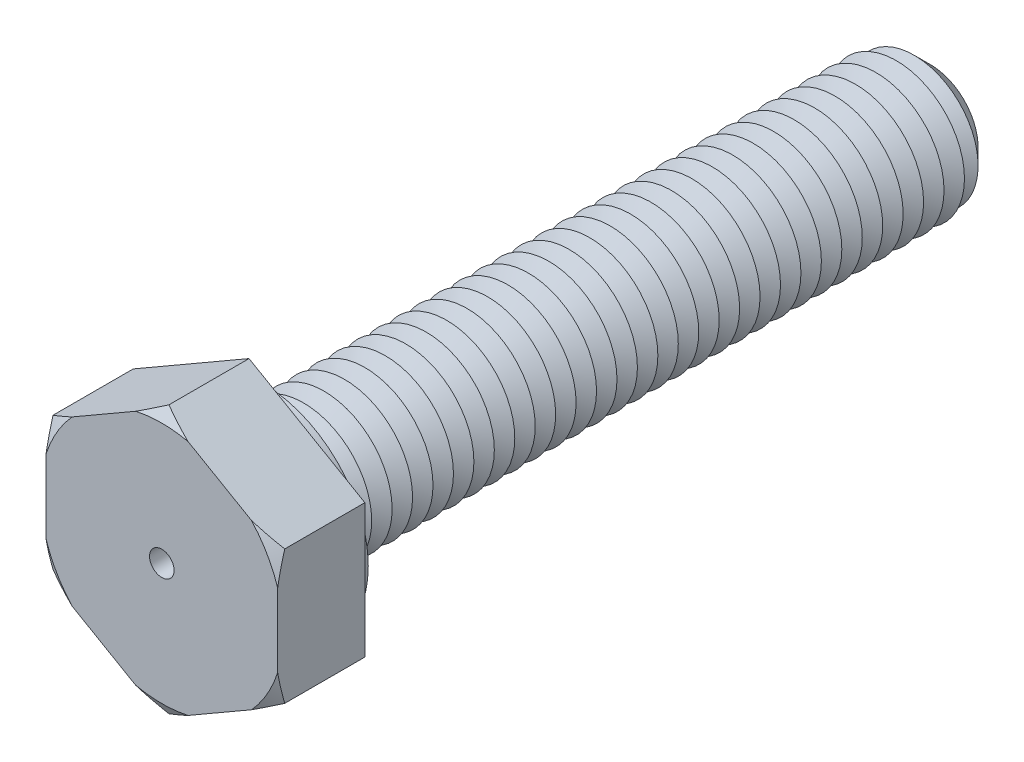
from build123d import *

# Parameters (mm, degrees)
BOSS_EXTRUDE1_DEPTH = 6.4
SKETCH3_R           = 5
BOSS_EXTRUDE2_DEPTH = 50
SKETCH4_R           = 7.75
BOSS_EXTRUDE3_DEPTH = 1
CHAMFER1_SIZE       = 1.5
LPATTERN1_COUNT     = 32
LPATTERN1_PITCH     = 1.5
SKETCH8_R           = 0.9
CUT_EXTRUDE1_DEPTH  = 56.4


with BuildPart() as part:
    # Sketch2 → Boss-Extrude1 (new body)
    with BuildSketch(Plane.XY):
        Polygon((0, 9.814954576), (-8.5, 4.907477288), (-8.5, -4.907477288), (0, -9.814954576), (8.5, -4.907477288), (8.5, 4.907477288), align=None)
    extrude(amount=BOSS_EXTRUDE1_DEPTH)

    # Sketch3 → Boss-Extrude2 (add)
    with BuildSketch(Plane(origin=(0, 0, 0), x_dir=(-1, 0, 0), z_dir=(0, 0, -1))):
        Circle(SKETCH3_R)
    extrude(amount=BOSS_EXTRUDE2_DEPTH)

    # Sketch4 → Boss-Extrude3 (add)
    with BuildSketch(Plane(origin=(0, 0, 0), x_dir=(-1, 0, 0), z_dir=(0, 0, -1))):
        with Locations(Location((0, 0, 0), (0, 0, 180))):
            Circle(SKETCH4_R)
    extrude(amount=BOSS_EXTRUDE3_DEPTH)

    # Chamfer1
    chamfer1_edges = [part.edges().sort_by_distance(p)[0] for p in [
        (5, 0, -50),
    ]]
    chamfer(chamfer1_edges, length=CHAMFER1_SIZE)

    # Sketch6 → Cut-Revolve1 (revolve, cut)
    with BuildSketch(Plane(origin=(0, 0, 0), x_dir=(0, 0, -1), z_dir=(1, 0, 0)), mode=Mode.PRIVATE) as cut_revolve1_sk:
        Polygon((1, 5), (1.75, 3.700961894), (2.5, 5), align=None)
    cut_revolve1 = revolve(cut_revolve1_sk.sketch.rotate(Axis((0, 0, 3.211670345), (0, 0, -1)), 90), axis=Axis((0, 0, 3.211670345), (0, 0, -1)), mode=Mode.SUBTRACT)

    # LPattern1: Cut-Revolve1 ×32
    with Locations(*[(0, 0, -i * LPATTERN1_PITCH) for i in range(1, LPATTERN1_COUNT)]):
        add(cut_revolve1, mode=Mode.SUBTRACT)

    # Sketch7 → Cut-Revolve2 (revolve, cut)
    with BuildSketch(Plane(origin=(0, 0, 0), x_dir=(0, 0, -1), z_dir=(1, 0, 0)), mode=Mode.PRIVATE) as cut_revolve2_sk:
        Polygon((-6.4, 9.814954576), (-6.4, 8.914954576), (-5.880384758, 9.814954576), align=None)
    revolve(cut_revolve2_sk.sketch.rotate(Axis((0, 0, 3.211670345), (0, 0, -1)), 270), axis=Axis((0, 0, 3.211670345), (0, 0, -1)), mode=Mode.SUBTRACT)

    # Sketch8 → Cut-Extrude1 (cut)
    with BuildSketch(Plane.XY.offset(6.4)):
        Circle(SKETCH8_R)
    extrude(amount=-CUT_EXTRUDE1_DEPTH, mode=Mode.SUBTRACT)


solid = part.part
